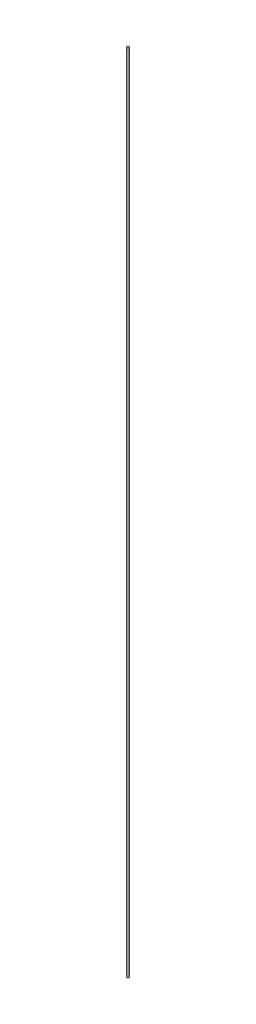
ISO-10303-21;
HEADER;
FILE_DESCRIPTION(('STEP AP214'),'2;1');
FILE_NAME('part.step','',(''),(''),'','','');
FILE_SCHEMA(('AUTOMOTIVE_DESIGN { 1 0 10303 214 1 1 1 1 }'));
ENDSEC;
DATA;
#1=APPLICATION_CONTEXT('core data for automotive mechanical design processes');
#2=APPLICATION_PROTOCOL_DEFINITION('international standard','automotive_design',2000,#1);
#3=PRODUCT_CONTEXT('',#1,'mechanical');
#4=PRODUCT('Part','Part','',(#3));
#5=PRODUCT_RELATED_PRODUCT_CATEGORY('part','',(#4));
#6=PRODUCT_DEFINITION_FORMATION('','',#4);
#7=PRODUCT_DEFINITION_CONTEXT('part definition',#1,'design');
#8=PRODUCT_DEFINITION('design','',#6,#7);
#9=PRODUCT_DEFINITION_SHAPE('','',#8);
#10=(LENGTH_UNIT() NAMED_UNIT(*) SI_UNIT(.MILLI.,.METRE.));
#11=(NAMED_UNIT(*) PLANE_ANGLE_UNIT() SI_UNIT($,.RADIAN.));
#12=(NAMED_UNIT(*) SI_UNIT($,.STERADIAN.) SOLID_ANGLE_UNIT());
#13=UNCERTAINTY_MEASURE_WITH_UNIT(LENGTH_MEASURE(1.E-05),#10,'distance_accuracy_value','');
#14=(GEOMETRIC_REPRESENTATION_CONTEXT(3) GLOBAL_UNCERTAINTY_ASSIGNED_CONTEXT((#13)) GLOBAL_UNIT_ASSIGNED_CONTEXT((#10,
#11,#12)) REPRESENTATION_CONTEXT('',''));
#15=CARTESIAN_POINT('',(0.,0.,0.));
#16=DIRECTION('',(0.,0.,1.));
#17=DIRECTION('',(1.,0.,0.));
#18=AXIS2_PLACEMENT_3D('',#15,#16,#17);
#19=CARTESIAN_POINT('',(0.,1071.,0.));
#20=DIRECTION('',(0.,-1.,0.));
#21=DIRECTION('',(0.,0.,-1.));
#22=AXIS2_PLACEMENT_3D('',#19,#20,#21);
#23=CYLINDRICAL_SURFACE('',#22,1.5);
#24=CARTESIAN_POINT('',(0.,1071.,0.));
#25=DIRECTION('',(0.,1.,0.));
#26=DIRECTION('',(0.,0.,1.));
#27=AXIS2_PLACEMENT_3D('',#24,#25,#26);
#28=CIRCLE('',#27,1.5);
#29=CARTESIAN_POINT('',(0.,1071.,1.5));
#30=VERTEX_POINT('',#29);
#31=EDGE_CURVE('E10',#30,#30,#28,.T.);
#32=ORIENTED_EDGE('',*,*,#31,.F.);
#33=EDGE_LOOP('',(#32));
#34=FACE_BOUND('',#33,.T.);
#35=CARTESIAN_POINT('',(0.,0.,0.));
#36=DIRECTION('',(0.,1.,0.));
#37=DIRECTION('',(0.,0.,1.));
#38=AXIS2_PLACEMENT_3D('',#35,#36,#37);
#39=CIRCLE('',#38,1.5);
#40=CARTESIAN_POINT('',(0.,0.,1.5));
#41=VERTEX_POINT('',#40);
#42=EDGE_CURVE('E33',#41,#41,#39,.T.);
#43=ORIENTED_EDGE('',*,*,#42,.T.);
#44=EDGE_LOOP('',(#43));
#45=FACE_BOUND('',#44,.T.);
#46=ADVANCED_FACE('F30',(#34,#45),#23,.T.);
#47=CARTESIAN_POINT('',(0.,1071.,0.));
#48=DIRECTION('',(0.,1.,0.));
#49=DIRECTION('',(0.,0.,1.));
#50=AXIS2_PLACEMENT_3D('',#47,#48,#49);
#51=PLANE('',#50);
#52=ORIENTED_EDGE('',*,*,#31,.T.);
#53=EDGE_LOOP('',(#52));
#54=FACE_BOUND('',#53,.T.);
#55=ADVANCED_FACE('F45',(#54),#51,.T.);
#56=CARTESIAN_POINT('',(0.,0.,0.));
#57=DIRECTION('',(0.,1.,0.));
#58=DIRECTION('',(0.,0.,1.));
#59=AXIS2_PLACEMENT_3D('',#56,#57,#58);
#60=PLANE('',#59);
#61=ORIENTED_EDGE('',*,*,#42,.F.);
#62=EDGE_LOOP('',(#61));
#63=FACE_BOUND('',#62,.T.);
#64=ADVANCED_FACE('F43',(#63),#60,.F.);
#65=CLOSED_SHELL('',(#46,#55,#64));
#66=MANIFOLD_SOLID_BREP('B2',#65);
#67=ADVANCED_BREP_SHAPE_REPRESENTATION('',(#18,#66),#14);
#68=SHAPE_DEFINITION_REPRESENTATION(#9,#67);
ENDSEC;
END-ISO-10303-21;
